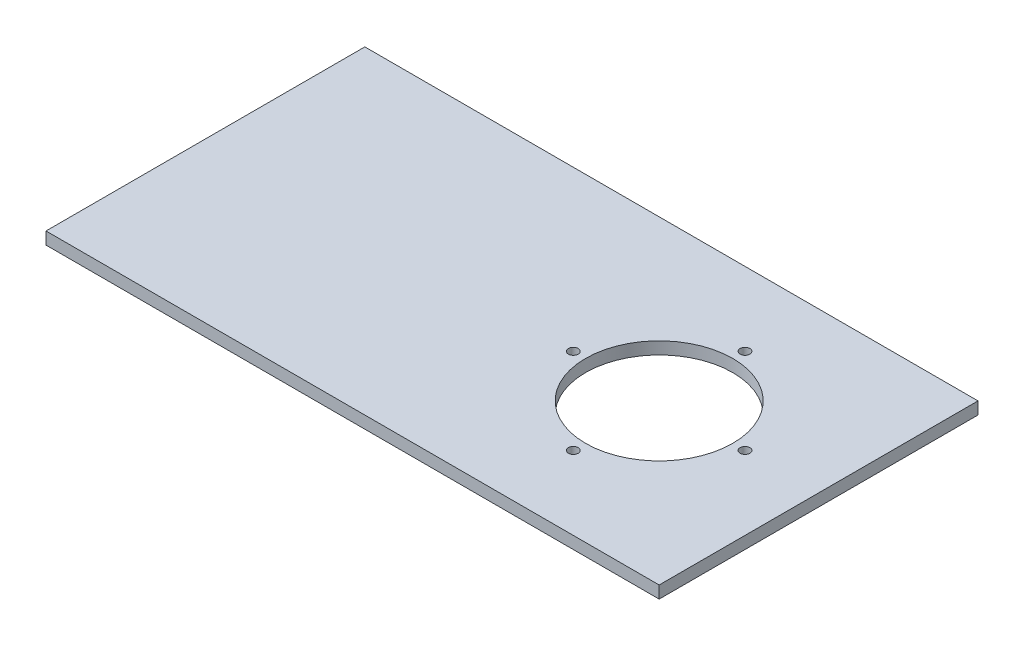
from build123d import *

# Parameters (mm, degrees)
SKETCH1_W           = 317.5
SKETCH1_H           = 165.1
BOSS_EXTRUDE1_DEPTH = 6.35
SKETCH2_R           = 38.1
CUT_EXTRUDE1_DEPTH  = 6.35
SKETCH3_R           = 2.54
CUT_EXTRUDE2_DEPTH  = 6.35


with BuildPart() as part:
    # Sketch1 → Boss-Extrude1 (new body)
    with BuildSketch(Plane(origin=(0, 0, 0), x_dir=(1, 0, 0), z_dir=(0, 1, 0))):
        with Locations((158.75, 82.55)):
            Rectangle(SKETCH1_W, SKETCH1_H)
    extrude(amount=BOSS_EXTRUDE1_DEPTH)

    # Sketch2 → Cut-Extrude1 (cut)
    with BuildSketch(Plane(origin=(0, 6.35, 0), x_dir=(1, 0, 0), z_dir=(0, 1, 0))):
        with Locations(Location((234.95, 82.55, 0), (0, 0, 270))):
            Circle(SKETCH2_R)
    extrude(amount=-CUT_EXTRUDE1_DEPTH, mode=Mode.SUBTRACT)

    # Sketch3 → Cut-Extrude2 (cut)
    with BuildSketch(Plane(origin=(0, 6.35, 0), x_dir=(1, 0, 0), z_dir=(0, 1, 0))):
        with Locations(Location((234.95, 127, 0), (0, 0, 270))):
            Circle(SKETCH3_R)
        with Locations(Location((279.4, 82.55, 0), (0, 0, 270))):
            Circle(SKETCH3_R)
        with Locations(Location((234.95, 38.1, 0), (0, 0, 270))):
            Circle(SKETCH3_R)
        with Locations(Location((190.5, 82.55, 0), (0, 0, 270))):
            Circle(SKETCH3_R)
    extrude(amount=-CUT_EXTRUDE2_DEPTH, mode=Mode.SUBTRACT)


solid = part.part
